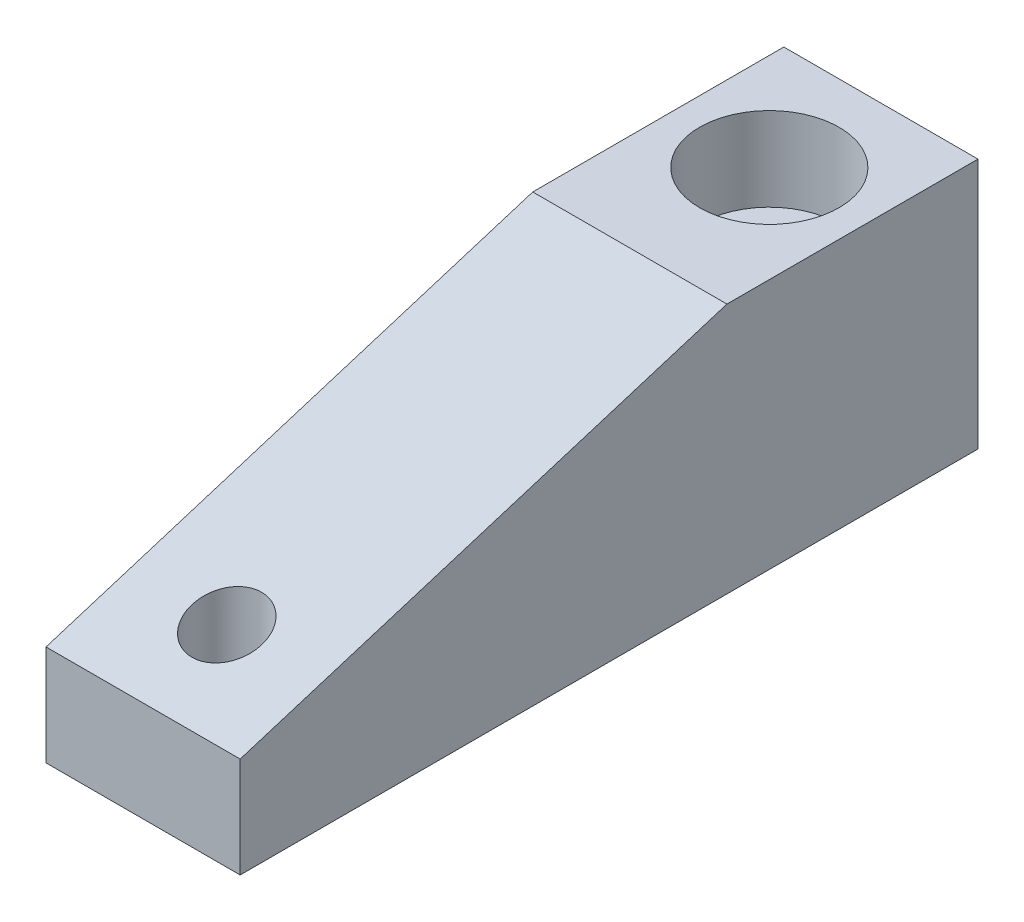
ISO-10303-21;
HEADER;
FILE_DESCRIPTION(('STEP AP214'),'2;1');
FILE_NAME('part.step','',(''),(''),'','','');
FILE_SCHEMA(('AUTOMOTIVE_DESIGN { 1 0 10303 214 1 1 1 1 }'));
ENDSEC;
DATA;
#1=APPLICATION_CONTEXT('core data for automotive mechanical design processes');
#2=APPLICATION_PROTOCOL_DEFINITION('international standard','automotive_design',2000,#1);
#3=PRODUCT_CONTEXT('',#1,'mechanical');
#4=PRODUCT('Part','Part','',(#3));
#5=PRODUCT_RELATED_PRODUCT_CATEGORY('part','',(#4));
#6=PRODUCT_DEFINITION_FORMATION('','',#4);
#7=PRODUCT_DEFINITION_CONTEXT('part definition',#1,'design');
#8=PRODUCT_DEFINITION('design','',#6,#7);
#9=PRODUCT_DEFINITION_SHAPE('','',#8);
#10=(LENGTH_UNIT() NAMED_UNIT(*) SI_UNIT(.MILLI.,.METRE.));
#11=(NAMED_UNIT(*) PLANE_ANGLE_UNIT() SI_UNIT($,.RADIAN.));
#12=(NAMED_UNIT(*) SI_UNIT($,.STERADIAN.) SOLID_ANGLE_UNIT());
#13=UNCERTAINTY_MEASURE_WITH_UNIT(LENGTH_MEASURE(1.E-05),#10,'distance_accuracy_value','');
#14=(GEOMETRIC_REPRESENTATION_CONTEXT(3) GLOBAL_UNCERTAINTY_ASSIGNED_CONTEXT((#13)) GLOBAL_UNIT_ASSIGNED_CONTEXT((#10,
#11,#12)) REPRESENTATION_CONTEXT('',''));
#15=CARTESIAN_POINT('',(0.,0.,0.));
#16=DIRECTION('',(0.,0.,1.));
#17=DIRECTION('',(1.,0.,0.));
#18=AXIS2_PLACEMENT_3D('',#15,#16,#17);
#19=CARTESIAN_POINT('',(0.,28.575,0.));
#20=DIRECTION('',(1.,0.,0.));
#21=DIRECTION('',(0.,0.,-1.));
#22=AXIS2_PLACEMENT_3D('',#19,#20,#21);
#23=PLANE('',#22);
#24=DIRECTION('',(0.,-1.,0.));
#25=VECTOR('',#24,1.);
#26=CARTESIAN_POINT('',(0.,28.575,83.9724));
#27=LINE('',#26,#25);
#28=CARTESIAN_POINT('',(0.,11.43,83.9724));
#29=VERTEX_POINT('',#28);
#30=CARTESIAN_POINT('',(0.,0.,83.9724));
#31=VERTEX_POINT('',#30);
#32=EDGE_CURVE('E115',#29,#31,#27,.T.);
#33=ORIENTED_EDGE('',*,*,#32,.F.);
#34=DIRECTION('',(0.,0.295655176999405,-0.955294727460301));
#35=VECTOR('',#34,1.);
#36=CARTESIAN_POINT('',(0.,11.43,83.9724));
#37=LINE('',#36,#35);
#38=CARTESIAN_POINT('',(0.,28.575,28.575));
#39=VERTEX_POINT('',#38);
#40=EDGE_CURVE('E181',#29,#39,#37,.T.);
#41=ORIENTED_EDGE('',*,*,#40,.T.);
#42=DIRECTION('',(0.,0.,1.));
#43=VECTOR('',#42,1.);
#44=CARTESIAN_POINT('',(0.,28.575,0.));
#45=LINE('',#44,#43);
#46=CARTESIAN_POINT('',(0.,28.575,0.));
#47=VERTEX_POINT('',#46);
#48=EDGE_CURVE('E89',#47,#39,#45,.T.);
#49=ORIENTED_EDGE('',*,*,#48,.F.);
#50=DIRECTION('',(0.,-1.,0.));
#51=VECTOR('',#50,1.);
#52=CARTESIAN_POINT('',(0.,28.575,0.));
#53=LINE('',#52,#51);
#54=CARTESIAN_POINT('',(0.,0.,0.));
#55=VERTEX_POINT('',#54);
#56=EDGE_CURVE('E82',#47,#55,#53,.T.);
#57=ORIENTED_EDGE('',*,*,#56,.T.);
#58=DIRECTION('',(0.,0.,1.));
#59=VECTOR('',#58,1.);
#60=CARTESIAN_POINT('',(0.,0.,0.));
#61=LINE('',#60,#59);
#62=EDGE_CURVE('E95',#55,#31,#61,.T.);
#63=ORIENTED_EDGE('',*,*,#62,.T.);
#64=EDGE_LOOP('',(#33,#41,#49,#57,#63));
#65=FACE_BOUND('',#64,.T.);
#66=ADVANCED_FACE('F35',(#65),#23,.F.);
#67=CARTESIAN_POINT('',(0.,28.575,83.9724));
#68=DIRECTION('',(0.,0.,-1.));
#69=DIRECTION('',(-1.,0.,0.));
#70=AXIS2_PLACEMENT_3D('',#67,#68,#69);
#71=PLANE('',#70);
#72=DIRECTION('',(0.,-1.,0.));
#73=VECTOR('',#72,1.);
#74=CARTESIAN_POINT('',(22.098,28.575,83.9724));
#75=LINE('',#74,#73);
#76=CARTESIAN_POINT('',(22.098,11.43,83.9724));
#77=VERTEX_POINT('',#76);
#78=CARTESIAN_POINT('',(22.098,0.,83.9724));
#79=VERTEX_POINT('',#78);
#80=EDGE_CURVE('E113',#77,#79,#75,.T.);
#81=ORIENTED_EDGE('',*,*,#80,.F.);
#82=DIRECTION('',(1.,0.,0.));
#83=VECTOR('',#82,1.);
#84=CARTESIAN_POINT('',(0.,11.43,83.9724));
#85=LINE('',#84,#83);
#86=EDGE_CURVE('E185',#29,#77,#85,.T.);
#87=ORIENTED_EDGE('',*,*,#86,.F.);
#88=ORIENTED_EDGE('',*,*,#32,.T.);
#89=DIRECTION('',(1.,0.,0.));
#90=VECTOR('',#89,1.);
#91=CARTESIAN_POINT('',(0.,0.,83.9724));
#92=LINE('',#91,#90);
#93=EDGE_CURVE('E101',#31,#79,#92,.T.);
#94=ORIENTED_EDGE('',*,*,#93,.T.);
#95=EDGE_LOOP('',(#81,#87,#88,#94));
#96=FACE_BOUND('',#95,.T.);
#97=ADVANCED_FACE('F137',(#96),#71,.F.);
#98=CARTESIAN_POINT('',(22.098,28.575,0.));
#99=DIRECTION('',(-1.,0.,0.));
#100=DIRECTION('',(0.,0.,1.));
#101=AXIS2_PLACEMENT_3D('',#98,#99,#100);
#102=PLANE('',#101);
#103=DIRECTION('',(0.,0.,-1.));
#104=VECTOR('',#103,1.);
#105=CARTESIAN_POINT('',(22.098,28.575,0.));
#106=LINE('',#105,#104);
#107=CARTESIAN_POINT('',(22.098,28.575,28.575));
#108=VERTEX_POINT('',#107);
#109=CARTESIAN_POINT('',(22.098,28.575,0.));
#110=VERTEX_POINT('',#109);
#111=EDGE_CURVE('E201',#108,#110,#106,.T.);
#112=ORIENTED_EDGE('',*,*,#111,.F.);
#113=DIRECTION('',(0.,0.295655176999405,-0.955294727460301));
#114=VECTOR('',#113,1.);
#115=CARTESIAN_POINT('',(22.098,11.43,83.9724));
#116=LINE('',#115,#114);
#117=EDGE_CURVE('E51',#77,#108,#116,.T.);
#118=ORIENTED_EDGE('',*,*,#117,.F.);
#119=ORIENTED_EDGE('',*,*,#80,.T.);
#120=DIRECTION('',(0.,0.,-1.));
#121=VECTOR('',#120,1.);
#122=CARTESIAN_POINT('',(22.098,0.,0.));
#123=LINE('',#122,#121);
#124=CARTESIAN_POINT('',(22.098,0.,0.));
#125=VERTEX_POINT('',#124);
#126=EDGE_CURVE('E90',#79,#125,#123,.T.);
#127=ORIENTED_EDGE('',*,*,#126,.T.);
#128=DIRECTION('',(0.,-1.,0.));
#129=VECTOR('',#128,1.);
#130=CARTESIAN_POINT('',(22.098,28.575,0.));
#131=LINE('',#130,#129);
#132=EDGE_CURVE('E85',#110,#125,#131,.T.);
#133=ORIENTED_EDGE('',*,*,#132,.F.);
#134=EDGE_LOOP('',(#112,#118,#119,#127,#133));
#135=FACE_BOUND('',#134,.T.);
#136=ADVANCED_FACE('F141',(#135),#102,.F.);
#137=CARTESIAN_POINT('',(0.,28.575,0.));
#138=DIRECTION('',(0.,0.,1.));
#139=DIRECTION('',(1.,0.,0.));
#140=AXIS2_PLACEMENT_3D('',#137,#138,#139);
#141=PLANE('',#140);
#142=DIRECTION('',(-1.,0.,0.));
#143=VECTOR('',#142,1.);
#144=CARTESIAN_POINT('',(0.,0.,0.));
#145=LINE('',#144,#143);
#146=EDGE_CURVE('E79',#125,#55,#145,.T.);
#147=ORIENTED_EDGE('',*,*,#146,.T.);
#148=ORIENTED_EDGE('',*,*,#56,.F.);
#149=DIRECTION('',(-1.,0.,0.));
#150=VECTOR('',#149,1.);
#151=CARTESIAN_POINT('',(0.,28.575,0.));
#152=LINE('',#151,#150);
#153=EDGE_CURVE('E60',#110,#47,#152,.T.);
#154=ORIENTED_EDGE('',*,*,#153,.F.);
#155=ORIENTED_EDGE('',*,*,#132,.T.);
#156=EDGE_LOOP('',(#147,#148,#154,#155));
#157=FACE_BOUND('',#156,.T.);
#158=ADVANCED_FACE('F81',(#157),#141,.F.);
#159=CARTESIAN_POINT('',(0.,28.575,83.9724));
#160=DIRECTION('',(0.,1.,0.));
#161=DIRECTION('',(0.,0.,1.));
#162=AXIS2_PLACEMENT_3D('',#159,#160,#161);
#163=PLANE('',#162);
#164=DIRECTION('',(1.,0.,0.));
#165=VECTOR('',#164,1.);
#166=CARTESIAN_POINT('',(0.,28.575,28.575));
#167=LINE('',#166,#165);
#168=EDGE_CURVE('E187',#39,#108,#167,.T.);
#169=ORIENTED_EDGE('',*,*,#168,.T.);
#170=ORIENTED_EDGE('',*,*,#111,.T.);
#171=ORIENTED_EDGE('',*,*,#153,.T.);
#172=ORIENTED_EDGE('',*,*,#48,.T.);
#173=EDGE_LOOP('',(#169,#170,#171,#172));
#174=FACE_BOUND('',#173,.T.);
#175=CARTESIAN_POINT('',(11.049,28.575,12.7));
#176=DIRECTION('',(0.,1.,0.));
#177=DIRECTION('',(0.,0.,1.));
#178=AXIS2_PLACEMENT_3D('',#175,#176,#177);
#179=CIRCLE('',#178,7.9375);
#180=CARTESIAN_POINT('',(11.049,28.575,20.6375));
#181=VERTEX_POINT('',#180);
#182=EDGE_CURVE('E102',#181,#181,#179,.T.);
#183=ORIENTED_EDGE('',*,*,#182,.F.);
#184=EDGE_LOOP('',(#183));
#185=FACE_BOUND('',#184,.T.);
#186=ADVANCED_FACE('F150',(#174,#185),#163,.T.);
#187=CARTESIAN_POINT('',(0.,0.,83.9724));
#188=DIRECTION('',(0.,1.,0.));
#189=DIRECTION('',(0.,0.,1.));
#190=AXIS2_PLACEMENT_3D('',#187,#188,#189);
#191=PLANE('',#190);
#192=CARTESIAN_POINT('',(11.049,0.,74.4474));
#193=DIRECTION('',(0.,-1.,0.));
#194=DIRECTION('',(0.,0.,-1.));
#195=AXIS2_PLACEMENT_3D('',#192,#193,#194);
#196=CIRCLE('',#195,3.9624);
#197=CARTESIAN_POINT('',(11.049,0.,70.485));
#198=VERTEX_POINT('',#197);
#199=EDGE_CURVE('E178',#198,#198,#196,.T.);
#200=ORIENTED_EDGE('',*,*,#199,.F.);
#201=EDGE_LOOP('',(#200));
#202=FACE_BOUND('',#201,.T.);
#203=CARTESIAN_POINT('',(11.049,0.,12.7));
#204=DIRECTION('',(0.,1.,0.));
#205=DIRECTION('',(0.,0.,1.));
#206=AXIS2_PLACEMENT_3D('',#203,#204,#205);
#207=CIRCLE('',#206,9.4996);
#208=CARTESIAN_POINT('',(11.049,0.,22.1996));
#209=VERTEX_POINT('',#208);
#210=EDGE_CURVE('E189',#209,#209,#207,.T.);
#211=ORIENTED_EDGE('',*,*,#210,.T.);
#212=EDGE_LOOP('',(#211));
#213=FACE_BOUND('',#212,.T.);
#214=ORIENTED_EDGE('',*,*,#62,.F.);
#215=ORIENTED_EDGE('',*,*,#146,.F.);
#216=ORIENTED_EDGE('',*,*,#126,.F.);
#217=ORIENTED_EDGE('',*,*,#93,.F.);
#218=EDGE_LOOP('',(#214,#215,#216,#217));
#219=FACE_BOUND('',#218,.T.);
#220=ADVANCED_FACE('F99',(#202,#213,#219),#191,.F.);
#221=CARTESIAN_POINT('',(11.049,31.6794444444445,12.7));
#222=DIRECTION('',(0.,1.,0.));
#223=DIRECTION('',(0.,0.,1.));
#224=AXIS2_PLACEMENT_3D('',#221,#222,#223);
#225=CYLINDRICAL_SURFACE('',#224,7.9375);
#226=CARTESIAN_POINT('',(11.049,19.05,12.7));
#227=DIRECTION('',(0.,1.,0.));
#228=DIRECTION('',(0.,0.,1.));
#229=AXIS2_PLACEMENT_3D('',#226,#227,#228);
#230=CIRCLE('',#229,7.9375);
#231=CARTESIAN_POINT('',(11.049,19.05,20.6375));
#232=VERTEX_POINT('',#231);
#233=EDGE_CURVE('E106',#232,#232,#230,.T.);
#234=ORIENTED_EDGE('',*,*,#233,.F.);
#235=EDGE_LOOP('',(#234));
#236=FACE_BOUND('',#235,.T.);
#237=ORIENTED_EDGE('',*,*,#182,.T.);
#238=EDGE_LOOP('',(#237));
#239=FACE_BOUND('',#238,.T.);
#240=ADVANCED_FACE('F153',(#236,#239),#225,.F.);
#241=CARTESIAN_POINT('',(11.049,19.05,20.6375));
#242=DIRECTION('',(0.,-1.,0.));
#243=DIRECTION('',(0.,0.,-1.));
#244=AXIS2_PLACEMENT_3D('',#241,#242,#243);
#245=PLANE('',#244);
#246=CARTESIAN_POINT('',(11.049,19.05,12.7));
#247=DIRECTION('',(0.,1.,0.));
#248=DIRECTION('',(0.,0.,1.));
#249=AXIS2_PLACEMENT_3D('',#246,#247,#248);
#250=CIRCLE('',#249,4.953);
#251=CARTESIAN_POINT('',(11.049,19.05,17.653));
#252=VERTEX_POINT('',#251);
#253=EDGE_CURVE('E196',#252,#252,#250,.T.);
#254=ORIENTED_EDGE('',*,*,#253,.F.);
#255=EDGE_LOOP('',(#254));
#256=FACE_BOUND('',#255,.T.);
#257=ORIENTED_EDGE('',*,*,#233,.T.);
#258=EDGE_LOOP('',(#257));
#259=FACE_BOUND('',#258,.T.);
#260=ADVANCED_FACE('F159',(#256,#259),#245,.F.);
#261=CARTESIAN_POINT('',(11.049,31.6794444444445,12.7));
#262=DIRECTION('',(0.,1.,0.));
#263=DIRECTION('',(0.,0.,1.));
#264=AXIS2_PLACEMENT_3D('',#261,#262,#263);
#265=CYLINDRICAL_SURFACE('',#264,4.953);
#266=CARTESIAN_POINT('',(11.049,13.4874,12.7));
#267=DIRECTION('',(0.,1.,0.));
#268=DIRECTION('',(0.,0.,1.));
#269=AXIS2_PLACEMENT_3D('',#266,#267,#268);
#270=CIRCLE('',#269,4.953);
#271=CARTESIAN_POINT('',(11.049,13.4874,17.653));
#272=VERTEX_POINT('',#271);
#273=EDGE_CURVE('E193',#272,#272,#270,.T.);
#274=ORIENTED_EDGE('',*,*,#273,.F.);
#275=EDGE_LOOP('',(#274));
#276=FACE_BOUND('',#275,.T.);
#277=ORIENTED_EDGE('',*,*,#253,.T.);
#278=EDGE_LOOP('',(#277));
#279=FACE_BOUND('',#278,.T.);
#280=ADVANCED_FACE('F163',(#276,#279),#265,.F.);
#281=CARTESIAN_POINT('',(11.049,13.4874,17.653));
#282=DIRECTION('',(0.,1.,0.));
#283=DIRECTION('',(0.,0.,1.));
#284=AXIS2_PLACEMENT_3D('',#281,#282,#283);
#285=PLANE('',#284);
#286=CARTESIAN_POINT('',(11.049,13.4874,12.7));
#287=DIRECTION('',(0.,1.,0.));
#288=DIRECTION('',(0.,0.,1.));
#289=AXIS2_PLACEMENT_3D('',#286,#287,#288);
#290=CIRCLE('',#289,8.70652669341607);
#291=CARTESIAN_POINT('',(11.049,13.4874,21.4065266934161));
#292=VERTEX_POINT('',#291);
#293=EDGE_CURVE('E11',#292,#292,#290,.F.);
#294=ORIENTED_EDGE('',*,*,#293,.T.);
#295=EDGE_LOOP('',(#294));
#296=FACE_BOUND('',#295,.T.);
#297=ORIENTED_EDGE('',*,*,#273,.T.);
#298=EDGE_LOOP('',(#297));
#299=FACE_BOUND('',#298,.T.);
#300=ADVANCED_FACE('F133',(#296,#299),#285,.F.);
#301=CARTESIAN_POINT('',(11.049,13.4874,12.7));
#302=DIRECTION('',(0.,-1.,0.));
#303=DIRECTION('',(0.,0.,-1.));
#304=AXIS2_PLACEMENT_3D('',#301,#302,#303);
#305=CONICAL_SURFACE('',#304,9.07574137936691,0.0314159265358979);
#306=CARTESIAN_POINT('',(11.049,13.1183674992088,12.7));
#307=DIRECTION('',(0.,-1.,0.));
#308=DIRECTION('',(0.,0.,-1.));
#309=AXIS2_PLACEMENT_3D('',#306,#307,#308);
#310=CIRCLE('',#309,9.08733869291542);
#311=CARTESIAN_POINT('',(11.049,13.1183674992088,3.61266130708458));
#312=VERTEX_POINT('',#311);
#313=EDGE_CURVE('E44',#312,#312,#310,.F.);
#314=ORIENTED_EDGE('',*,*,#313,.T.);
#315=EDGE_LOOP('',(#314));
#316=FACE_BOUND('',#315,.T.);
#317=ORIENTED_EDGE('',*,*,#210,.F.);
#318=EDGE_LOOP('',(#317));
#319=FACE_BOUND('',#318,.T.);
#320=ADVANCED_FACE('F120',(#316,#319),#305,.F.);
#321=CARTESIAN_POINT('',(11.049,13.1064,12.7));
#322=DIRECTION('',(0.,1.,0.));
#323=DIRECTION('',(0.,0.,1.));
#324=AXIS2_PLACEMENT_3D('',#321,#322,#323);
#325=TOROIDAL_SURFACE('',#324,8.70652669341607,0.381);
#326=ORIENTED_EDGE('',*,*,#293,.F.);
#327=EDGE_LOOP('',(#326));
#328=FACE_BOUND('',#327,.T.);
#329=ORIENTED_EDGE('',*,*,#313,.F.);
#330=EDGE_LOOP('',(#329));
#331=FACE_BOUND('',#330,.T.);
#332=ADVANCED_FACE('F37',(#328,#331),#325,.F.);
#333=CARTESIAN_POINT('',(0.,11.43,83.9724));
#334=DIRECTION('',(0.,-0.955294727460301,-0.295655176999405));
#335=DIRECTION('',(0.,0.295655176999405,-0.955294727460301));
#336=AXIS2_PLACEMENT_3D('',#333,#334,#335);
#337=PLANE('',#336);
#338=CARTESIAN_POINT('',(11.049,14.3779023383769,74.4474));
#339=DIRECTION('',(0.,-0.955294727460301,-0.295655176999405));
#340=DIRECTION('',(0.,-0.295655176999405,0.955294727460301));
#341=AXIS2_PLACEMENT_3D('',#338,#339,#340);
#342=ELLIPSE('',#341,4.14782986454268,3.9624);
#343=CARTESIAN_POINT('',(11.049,13.1515749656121,78.4098));
#344=VERTEX_POINT('',#343);
#345=EDGE_CURVE('E39',#344,#344,#342,.T.);
#346=ORIENTED_EDGE('',*,*,#345,.T.);
#347=EDGE_LOOP('',(#346));
#348=FACE_BOUND('',#347,.T.);
#349=ORIENTED_EDGE('',*,*,#117,.T.);
#350=ORIENTED_EDGE('',*,*,#168,.F.);
#351=ORIENTED_EDGE('',*,*,#40,.F.);
#352=ORIENTED_EDGE('',*,*,#86,.T.);
#353=EDGE_LOOP('',(#349,#350,#351,#352));
#354=FACE_BOUND('',#353,.T.);
#355=ADVANCED_FACE('F124',(#348,#354),#337,.F.);
#356=CARTESIAN_POINT('',(11.049,28.575,74.4474));
#357=DIRECTION('',(0.,-1.,0.));
#358=DIRECTION('',(0.,0.,-1.));
#359=AXIS2_PLACEMENT_3D('',#356,#357,#358);
#360=CYLINDRICAL_SURFACE('',#359,3.9624);
#361=ORIENTED_EDGE('',*,*,#199,.T.);
#362=EDGE_LOOP('',(#361));
#363=FACE_BOUND('',#362,.T.);
#364=ORIENTED_EDGE('',*,*,#345,.F.);
#365=EDGE_LOOP('',(#364));
#366=FACE_BOUND('',#365,.T.);
#367=ADVANCED_FACE('F130',(#363,#366),#360,.F.);
#368=CLOSED_SHELL('',(#66,#97,#136,#158,#186,#220,#240,#260,#280,#300,#320,#332,#355,#367));
#369=MANIFOLD_SOLID_BREP('B2',#368);
#370=ADVANCED_BREP_SHAPE_REPRESENTATION('',(#18,#369),#14);
#371=SHAPE_DEFINITION_REPRESENTATION(#9,#370);
ENDSEC;
END-ISO-10303-21;
